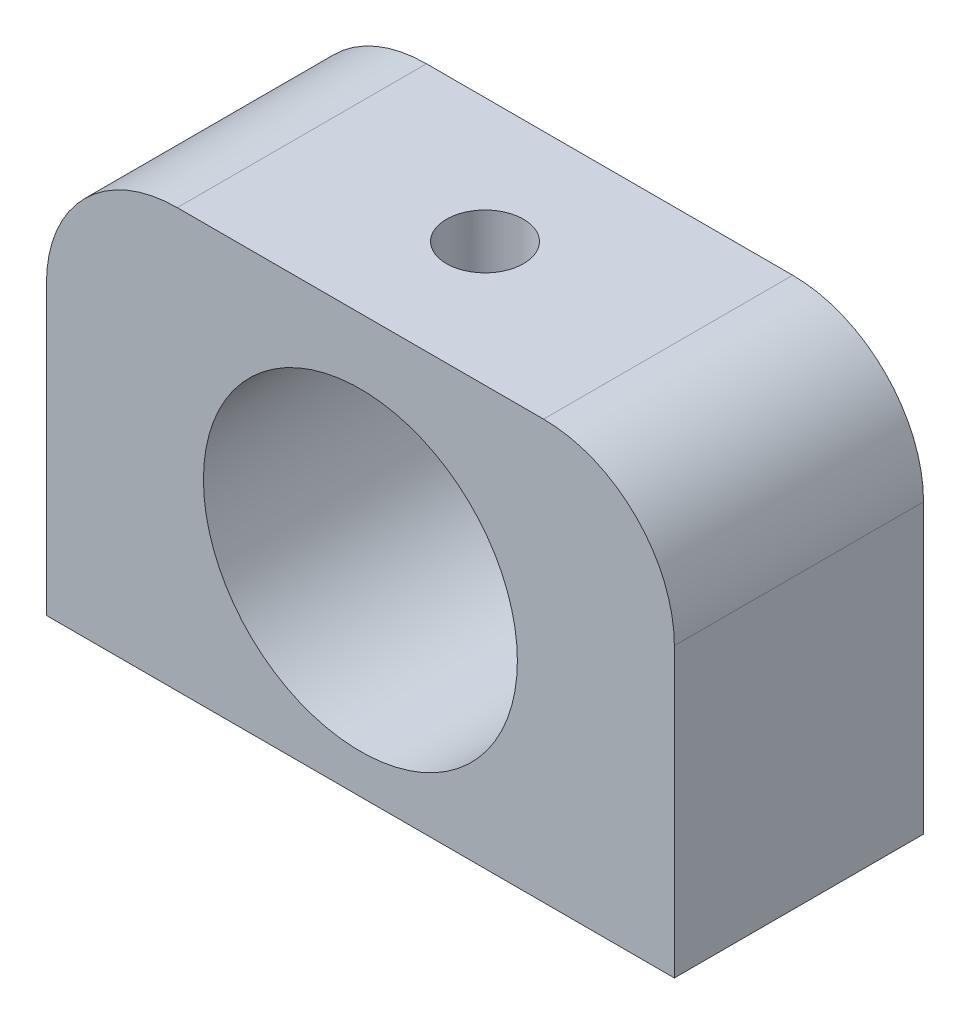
ISO-10303-21;
HEADER;
FILE_DESCRIPTION(('STEP AP214'),'2;1');
FILE_NAME('part.step','',(''),(''),'','','');
FILE_SCHEMA(('AUTOMOTIVE_DESIGN { 1 0 10303 214 1 1 1 1 }'));
ENDSEC;
DATA;
#1=APPLICATION_CONTEXT('core data for automotive mechanical design processes');
#2=APPLICATION_PROTOCOL_DEFINITION('international standard','automotive_design',2000,#1);
#3=PRODUCT_CONTEXT('',#1,'mechanical');
#4=PRODUCT('Part','Part','',(#3));
#5=PRODUCT_RELATED_PRODUCT_CATEGORY('part','',(#4));
#6=PRODUCT_DEFINITION_FORMATION('','',#4);
#7=PRODUCT_DEFINITION_CONTEXT('part definition',#1,'design');
#8=PRODUCT_DEFINITION('design','',#6,#7);
#9=PRODUCT_DEFINITION_SHAPE('','',#8);
#10=(LENGTH_UNIT() NAMED_UNIT(*) SI_UNIT(.MILLI.,.METRE.));
#11=(NAMED_UNIT(*) PLANE_ANGLE_UNIT() SI_UNIT($,.RADIAN.));
#12=(NAMED_UNIT(*) SI_UNIT($,.STERADIAN.) SOLID_ANGLE_UNIT());
#13=UNCERTAINTY_MEASURE_WITH_UNIT(LENGTH_MEASURE(1.E-05),#10,'distance_accuracy_value','');
#14=(GEOMETRIC_REPRESENTATION_CONTEXT(3) GLOBAL_UNCERTAINTY_ASSIGNED_CONTEXT((#13)) GLOBAL_UNIT_ASSIGNED_CONTEXT((#10,
#11,#12)) REPRESENTATION_CONTEXT('',''));
#15=CARTESIAN_POINT('',(0.,0.,0.));
#16=DIRECTION('',(0.,0.,1.));
#17=DIRECTION('',(1.,0.,0.));
#18=AXIS2_PLACEMENT_3D('',#15,#16,#17);
#19=CARTESIAN_POINT('',(0.,0.,9.525));
#20=DIRECTION('',(1.,0.,0.));
#21=DIRECTION('',(0.,0.,-1.));
#22=AXIS2_PLACEMENT_3D('',#19,#20,#21);
#23=PLANE('',#22);
#24=DIRECTION('',(0.,-1.,0.));
#25=VECTOR('',#24,1.);
#26=CARTESIAN_POINT('',(0.,0.,9.525));
#27=LINE('',#26,#25);
#28=CARTESIAN_POINT('',(0.,11.,9.525));
#29=VERTEX_POINT('',#28);
#30=CARTESIAN_POINT('',(0.,0.,9.525));
#31=VERTEX_POINT('',#30);
#32=EDGE_CURVE('E116',#29,#31,#27,.T.);
#33=ORIENTED_EDGE('',*,*,#32,.F.);
#34=DIRECTION('',(0.,0.,-1.));
#35=VECTOR('',#34,1.);
#36=CARTESIAN_POINT('',(0.,11.,9.525));
#37=LINE('',#36,#35);
#38=CARTESIAN_POINT('',(0.,11.,0.));
#39=VERTEX_POINT('',#38);
#40=EDGE_CURVE('E11',#29,#39,#37,.T.);
#41=ORIENTED_EDGE('',*,*,#40,.T.);
#42=DIRECTION('',(0.,-1.,0.));
#43=VECTOR('',#42,1.);
#44=CARTESIAN_POINT('',(0.,0.,0.));
#45=LINE('',#44,#43);
#46=CARTESIAN_POINT('',(0.,0.,0.));
#47=VERTEX_POINT('',#46);
#48=EDGE_CURVE('E115',#39,#47,#45,.T.);
#49=ORIENTED_EDGE('',*,*,#48,.T.);
#50=DIRECTION('',(0.,0.,-1.));
#51=VECTOR('',#50,1.);
#52=CARTESIAN_POINT('',(0.,0.,9.525));
#53=LINE('',#52,#51);
#54=EDGE_CURVE('E135',#31,#47,#53,.T.);
#55=ORIENTED_EDGE('',*,*,#54,.F.);
#56=EDGE_LOOP('',(#33,#41,#49,#55));
#57=FACE_BOUND('',#56,.T.);
#58=ADVANCED_FACE('F32',(#57),#23,.F.);
#59=CARTESIAN_POINT('',(0.,0.,9.525));
#60=DIRECTION('',(0.,1.,0.));
#61=DIRECTION('',(0.,0.,1.));
#62=AXIS2_PLACEMENT_3D('',#59,#60,#61);
#63=PLANE('',#62);
#64=CARTESIAN_POINT('',(3.,0.,4.7625));
#65=DIRECTION('',(0.,-1.,0.));
#66=DIRECTION('',(0.,0.,-1.));
#67=AXIS2_PLACEMENT_3D('',#64,#65,#66);
#68=CIRCLE('',#67,1.63194999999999);
#69=CARTESIAN_POINT('',(3.,0.,3.13055000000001));
#70=VERTEX_POINT('',#69);
#71=EDGE_CURVE('E103',#70,#70,#68,.T.);
#72=ORIENTED_EDGE('',*,*,#71,.F.);
#73=EDGE_LOOP('',(#72));
#74=FACE_BOUND('',#73,.T.);
#75=CARTESIAN_POINT('',(21.,0.,4.7625));
#76=DIRECTION('',(0.,-1.,0.));
#77=DIRECTION('',(0.,0.,-1.));
#78=AXIS2_PLACEMENT_3D('',#75,#76,#77);
#79=CIRCLE('',#78,1.63194999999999);
#80=CARTESIAN_POINT('',(21.,0.,3.13055000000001));
#81=VERTEX_POINT('',#80);
#82=EDGE_CURVE('E102',#81,#81,#79,.T.);
#83=ORIENTED_EDGE('',*,*,#82,.F.);
#84=EDGE_LOOP('',(#83));
#85=FACE_BOUND('',#84,.T.);
#86=DIRECTION('',(1.,0.,0.));
#87=VECTOR('',#86,1.);
#88=CARTESIAN_POINT('',(0.,0.,0.));
#89=LINE('',#88,#87);
#90=CARTESIAN_POINT('',(24.,0.,0.));
#91=VERTEX_POINT('',#90);
#92=EDGE_CURVE('E127',#47,#91,#89,.T.);
#93=ORIENTED_EDGE('',*,*,#92,.T.);
#94=DIRECTION('',(0.,0.,-1.));
#95=VECTOR('',#94,1.);
#96=CARTESIAN_POINT('',(24.,0.,9.525));
#97=LINE('',#96,#95);
#98=CARTESIAN_POINT('',(24.,0.,9.525));
#99=VERTEX_POINT('',#98);
#100=EDGE_CURVE('E125',#99,#91,#97,.T.);
#101=ORIENTED_EDGE('',*,*,#100,.F.);
#102=DIRECTION('',(1.,0.,0.));
#103=VECTOR('',#102,1.);
#104=CARTESIAN_POINT('',(0.,0.,9.525));
#105=LINE('',#104,#103);
#106=EDGE_CURVE('E118',#31,#99,#105,.T.);
#107=ORIENTED_EDGE('',*,*,#106,.F.);
#108=ORIENTED_EDGE('',*,*,#54,.T.);
#109=EDGE_LOOP('',(#93,#101,#107,#108));
#110=FACE_BOUND('',#109,.T.);
#111=ADVANCED_FACE('F166',(#74,#85,#110),#63,.F.);
#112=CARTESIAN_POINT('',(24.,0.,9.525));
#113=DIRECTION('',(-1.,0.,0.));
#114=DIRECTION('',(0.,0.,1.));
#115=AXIS2_PLACEMENT_3D('',#112,#113,#114);
#116=PLANE('',#115);
#117=DIRECTION('',(0.,1.,0.));
#118=VECTOR('',#117,1.);
#119=CARTESIAN_POINT('',(24.,0.,0.));
#120=LINE('',#119,#118);
#121=CARTESIAN_POINT('',(24.,11.,0.));
#122=VERTEX_POINT('',#121);
#123=EDGE_CURVE('E129',#91,#122,#120,.T.);
#124=ORIENTED_EDGE('',*,*,#123,.T.);
#125=DIRECTION('',(0.,0.,-1.));
#126=VECTOR('',#125,1.);
#127=CARTESIAN_POINT('',(24.,11.,9.525));
#128=LINE('',#127,#126);
#129=CARTESIAN_POINT('',(24.,11.,9.525));
#130=VERTEX_POINT('',#129);
#131=EDGE_CURVE('E55',#122,#130,#128,.F.);
#132=ORIENTED_EDGE('',*,*,#131,.T.);
#133=DIRECTION('',(0.,1.,0.));
#134=VECTOR('',#133,1.);
#135=CARTESIAN_POINT('',(24.,0.,9.525));
#136=LINE('',#135,#134);
#137=EDGE_CURVE('E121',#99,#130,#136,.T.);
#138=ORIENTED_EDGE('',*,*,#137,.F.);
#139=ORIENTED_EDGE('',*,*,#100,.T.);
#140=EDGE_LOOP('',(#124,#132,#138,#139));
#141=FACE_BOUND('',#140,.T.);
#142=ADVANCED_FACE('F172',(#141),#116,.F.);
#143=CARTESIAN_POINT('',(0.,16.,9.525));
#144=DIRECTION('',(0.,-1.,0.));
#145=DIRECTION('',(0.,0.,-1.));
#146=AXIS2_PLACEMENT_3D('',#143,#144,#145);
#147=PLANE('',#146);
#148=CARTESIAN_POINT('',(12.,16.,4.7625));
#149=DIRECTION('',(0.,1.,0.));
#150=DIRECTION('',(0.,0.,1.));
#151=AXIS2_PLACEMENT_3D('',#148,#149,#150);
#152=CIRCLE('',#151,1.4732);
#153=CARTESIAN_POINT('',(12.,16.,6.2357));
#154=VERTEX_POINT('',#153);
#155=EDGE_CURVE('E147',#154,#154,#152,.T.);
#156=ORIENTED_EDGE('',*,*,#155,.F.);
#157=EDGE_LOOP('',(#156));
#158=FACE_BOUND('',#157,.T.);
#159=DIRECTION('',(-1.,0.,0.));
#160=VECTOR('',#159,1.);
#161=CARTESIAN_POINT('',(0.,16.,9.525));
#162=LINE('',#161,#160);
#163=CARTESIAN_POINT('',(19.,16.,9.525));
#164=VERTEX_POINT('',#163);
#165=CARTESIAN_POINT('',(5.,16.,9.525));
#166=VERTEX_POINT('',#165);
#167=EDGE_CURVE('E123',#164,#166,#162,.T.);
#168=ORIENTED_EDGE('',*,*,#167,.F.);
#169=DIRECTION('',(0.,0.,-1.));
#170=VECTOR('',#169,1.);
#171=CARTESIAN_POINT('',(19.,16.,9.525));
#172=LINE('',#171,#170);
#173=CARTESIAN_POINT('',(19.,16.,0.));
#174=VERTEX_POINT('',#173);
#175=EDGE_CURVE('E218',#164,#174,#172,.T.);
#176=ORIENTED_EDGE('',*,*,#175,.T.);
#177=DIRECTION('',(-1.,0.,0.));
#178=VECTOR('',#177,1.);
#179=CARTESIAN_POINT('',(0.,16.,0.));
#180=LINE('',#179,#178);
#181=CARTESIAN_POINT('',(5.,16.,0.));
#182=VERTEX_POINT('',#181);
#183=EDGE_CURVE('E119',#174,#182,#180,.T.);
#184=ORIENTED_EDGE('',*,*,#183,.T.);
#185=DIRECTION('',(0.,0.,-1.));
#186=VECTOR('',#185,1.);
#187=CARTESIAN_POINT('',(5.,16.,9.525));
#188=LINE('',#187,#186);
#189=EDGE_CURVE('E138',#182,#166,#188,.F.);
#190=ORIENTED_EDGE('',*,*,#189,.T.);
#191=EDGE_LOOP('',(#168,#176,#184,#190));
#192=FACE_BOUND('',#191,.T.);
#193=ADVANCED_FACE('F178',(#158,#192),#147,.F.);
#194=CARTESIAN_POINT('',(0.,0.,9.525));
#195=DIRECTION('',(0.,0.,-1.));
#196=DIRECTION('',(-1.,0.,0.));
#197=AXIS2_PLACEMENT_3D('',#194,#195,#196);
#198=PLANE('',#197);
#199=CARTESIAN_POINT('',(12.,7.5,9.525));
#200=DIRECTION('',(0.,0.,1.));
#201=DIRECTION('',(1.,0.,0.));
#202=AXIS2_PLACEMENT_3D('',#199,#200,#201);
#203=CIRCLE('',#202,6.);
#204=CARTESIAN_POINT('',(18.,7.5,9.525));
#205=VERTEX_POINT('',#204);
#206=EDGE_CURVE('E146',#205,#205,#203,.T.);
#207=ORIENTED_EDGE('',*,*,#206,.F.);
#208=EDGE_LOOP('',(#207));
#209=FACE_BOUND('',#208,.T.);
#210=ORIENTED_EDGE('',*,*,#137,.T.);
#211=CARTESIAN_POINT('',(19.,11.,9.525));
#212=DIRECTION('',(0.,0.,-1.));
#213=DIRECTION('',(-1.,0.,0.));
#214=AXIS2_PLACEMENT_3D('',#211,#212,#213);
#215=CIRCLE('',#214,5.);
#216=EDGE_CURVE('E40',#130,#164,#215,.F.);
#217=ORIENTED_EDGE('',*,*,#216,.T.);
#218=ORIENTED_EDGE('',*,*,#167,.T.);
#219=CARTESIAN_POINT('',(5.,11.,9.525));
#220=DIRECTION('',(0.,0.,-1.));
#221=DIRECTION('',(-1.,0.,0.));
#222=AXIS2_PLACEMENT_3D('',#219,#220,#221);
#223=CIRCLE('',#222,5.);
#224=EDGE_CURVE('E47',#166,#29,#223,.F.);
#225=ORIENTED_EDGE('',*,*,#224,.T.);
#226=ORIENTED_EDGE('',*,*,#32,.T.);
#227=ORIENTED_EDGE('',*,*,#106,.T.);
#228=EDGE_LOOP('',(#210,#217,#218,#225,#226,#227));
#229=FACE_BOUND('',#228,.T.);
#230=ADVANCED_FACE('F181',(#209,#229),#198,.F.);
#231=CARTESIAN_POINT('',(0.,0.,0.));
#232=DIRECTION('',(0.,0.,-1.));
#233=DIRECTION('',(-1.,0.,0.));
#234=AXIS2_PLACEMENT_3D('',#231,#232,#233);
#235=PLANE('',#234);
#236=CARTESIAN_POINT('',(12.,7.5,0.));
#237=DIRECTION('',(0.,0.,1.));
#238=DIRECTION('',(1.,0.,0.));
#239=AXIS2_PLACEMENT_3D('',#236,#237,#238);
#240=CIRCLE('',#239,6.);
#241=CARTESIAN_POINT('',(18.,7.5,0.));
#242=VERTEX_POINT('',#241);
#243=EDGE_CURVE('E109',#242,#242,#240,.T.);
#244=ORIENTED_EDGE('',*,*,#243,.T.);
#245=EDGE_LOOP('',(#244));
#246=FACE_BOUND('',#245,.T.);
#247=ORIENTED_EDGE('',*,*,#183,.F.);
#248=CARTESIAN_POINT('',(19.,11.,0.));
#249=DIRECTION('',(0.,0.,-1.));
#250=DIRECTION('',(-1.,0.,0.));
#251=AXIS2_PLACEMENT_3D('',#248,#249,#250);
#252=CIRCLE('',#251,5.);
#253=EDGE_CURVE('E212',#174,#122,#252,.T.);
#254=ORIENTED_EDGE('',*,*,#253,.T.);
#255=ORIENTED_EDGE('',*,*,#123,.F.);
#256=ORIENTED_EDGE('',*,*,#92,.F.);
#257=ORIENTED_EDGE('',*,*,#48,.F.);
#258=CARTESIAN_POINT('',(5.,11.,0.));
#259=DIRECTION('',(0.,0.,-1.));
#260=DIRECTION('',(-1.,0.,0.));
#261=AXIS2_PLACEMENT_3D('',#258,#259,#260);
#262=CIRCLE('',#261,5.);
#263=EDGE_CURVE('E215',#39,#182,#262,.T.);
#264=ORIENTED_EDGE('',*,*,#263,.T.);
#265=EDGE_LOOP('',(#247,#254,#255,#256,#257,#264));
#266=FACE_BOUND('',#265,.T.);
#267=ADVANCED_FACE('F183',(#246,#266),#235,.T.);
#268=CARTESIAN_POINT('',(21.,12.7,4.7625));
#269=DIRECTION('',(0.,-1.,0.));
#270=DIRECTION('',(0.,0.,-1.));
#271=AXIS2_PLACEMENT_3D('',#268,#269,#270);
#272=CONICAL_SURFACE('',#271,1.63195,1.02974425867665);
#273=CARTESIAN_POINT('',(21.,13.680574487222,4.7625));
#274=VERTEX_POINT('',#273);
#275=VERTEX_LOOP('',#274);
#276=FACE_BOUND('',#275,.T.);
#277=CARTESIAN_POINT('',(21.,12.7,4.7625));
#278=DIRECTION('',(0.,-1.,0.));
#279=DIRECTION('',(0.,0.,-1.));
#280=AXIS2_PLACEMENT_3D('',#277,#278,#279);
#281=CIRCLE('',#280,1.63195);
#282=CARTESIAN_POINT('',(21.,12.7,3.13055));
#283=VERTEX_POINT('',#282);
#284=EDGE_CURVE('E106',#283,#283,#281,.T.);
#285=ORIENTED_EDGE('',*,*,#284,.T.);
#286=EDGE_LOOP('',(#285));
#287=FACE_BOUND('',#286,.T.);
#288=ADVANCED_FACE('F186',(#276,#287),#272,.F.);
#289=CARTESIAN_POINT('',(21.,0.,4.7625));
#290=DIRECTION('',(0.,-1.,0.));
#291=DIRECTION('',(0.,0.,-1.));
#292=AXIS2_PLACEMENT_3D('',#289,#290,#291);
#293=CYLINDRICAL_SURFACE('',#292,1.63194999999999);
#294=ORIENTED_EDGE('',*,*,#284,.F.);
#295=EDGE_LOOP('',(#294));
#296=FACE_BOUND('',#295,.T.);
#297=ORIENTED_EDGE('',*,*,#82,.T.);
#298=EDGE_LOOP('',(#297));
#299=FACE_BOUND('',#298,.T.);
#300=ADVANCED_FACE('F96',(#296,#299),#293,.F.);
#301=CARTESIAN_POINT('',(3.,12.7,4.7625));
#302=DIRECTION('',(0.,-1.,0.));
#303=DIRECTION('',(0.,0.,-1.));
#304=AXIS2_PLACEMENT_3D('',#301,#302,#303);
#305=CONICAL_SURFACE('',#304,1.63195,1.02974425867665);
#306=CARTESIAN_POINT('',(3.,13.680574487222,4.7625));
#307=VERTEX_POINT('',#306);
#308=VERTEX_LOOP('',#307);
#309=FACE_BOUND('',#308,.T.);
#310=CARTESIAN_POINT('',(3.,12.7,4.7625));
#311=DIRECTION('',(0.,-1.,0.));
#312=DIRECTION('',(0.,0.,-1.));
#313=AXIS2_PLACEMENT_3D('',#310,#311,#312);
#314=CIRCLE('',#313,1.63195);
#315=CARTESIAN_POINT('',(3.,12.7,3.13055));
#316=VERTEX_POINT('',#315);
#317=EDGE_CURVE('E100',#316,#316,#314,.T.);
#318=ORIENTED_EDGE('',*,*,#317,.T.);
#319=EDGE_LOOP('',(#318));
#320=FACE_BOUND('',#319,.T.);
#321=ADVANCED_FACE('F92',(#309,#320),#305,.F.);
#322=CARTESIAN_POINT('',(3.,0.,4.7625));
#323=DIRECTION('',(0.,-1.,0.));
#324=DIRECTION('',(0.,0.,-1.));
#325=AXIS2_PLACEMENT_3D('',#322,#323,#324);
#326=CYLINDRICAL_SURFACE('',#325,1.63194999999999);
#327=ORIENTED_EDGE('',*,*,#317,.F.);
#328=EDGE_LOOP('',(#327));
#329=FACE_BOUND('',#328,.T.);
#330=ORIENTED_EDGE('',*,*,#71,.T.);
#331=EDGE_LOOP('',(#330));
#332=FACE_BOUND('',#331,.T.);
#333=ADVANCED_FACE('F95',(#329,#332),#326,.F.);
#334=CARTESIAN_POINT('',(12.,7.5,0.));
#335=DIRECTION('',(0.,0.,1.));
#336=DIRECTION('',(1.,0.,0.));
#337=AXIS2_PLACEMENT_3D('',#334,#335,#336);
#338=CYLINDRICAL_SURFACE('',#337,6.);
#339=CARTESIAN_POINT('',(12.,13.5,6.2357));
#340=CARTESIAN_POINT('',(12.081442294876,13.4999985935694,6.2356976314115));
#341=CARTESIAN_POINT('',(12.1629113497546,13.4983252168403,6.22892375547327));
#342=CARTESIAN_POINT('',(12.323517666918,13.4918118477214,6.20204592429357));
#343=CARTESIAN_POINT('',(12.4026535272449,13.4869699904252,6.18193411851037));
#344=CARTESIAN_POINT('',(12.5562506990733,13.47465626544,6.12906223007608));
#345=CARTESIAN_POINT('',(12.6307173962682,13.4671874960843,6.09631704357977));
#346=CARTESIAN_POINT('',(12.7731002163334,13.4504169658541,6.01915956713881));
#347=CARTESIAN_POINT('',(12.8410161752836,13.4411151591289,5.97474698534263));
#348=CARTESIAN_POINT('',(12.9697227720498,13.4214826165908,5.8745807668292));
#349=CARTESIAN_POINT('',(13.0303643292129,13.4111364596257,5.81863858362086));
#350=CARTESIAN_POINT('',(13.1415054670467,13.3906846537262,5.69740499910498));
#351=CARTESIAN_POINT('',(13.1920039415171,13.38057903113,5.63211257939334));
#352=CARTESIAN_POINT('',(13.2821200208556,13.3615975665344,5.49288270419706));
#353=CARTESIAN_POINT('',(13.3215720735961,13.3527413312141,5.41883518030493));
#354=CARTESIAN_POINT('',(13.3874111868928,13.3374857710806,5.26490666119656));
#355=CARTESIAN_POINT('',(13.4138002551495,13.3310860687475,5.18502656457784));
#356=CARTESIAN_POINT('',(13.4522581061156,13.3216264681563,5.02333650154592));
#357=CARTESIAN_POINT('',(13.4645943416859,13.3185042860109,4.9415938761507));
#358=CARTESIAN_POINT('',(13.4754292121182,13.3157667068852,4.77714425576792));
#359=CARTESIAN_POINT('',(13.4739300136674,13.3161507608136,4.69443741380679));
#360=CARTESIAN_POINT('',(13.4573502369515,13.3203262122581,4.53244744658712));
#361=CARTESIAN_POINT('',(13.4425871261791,13.3240379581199,4.45312945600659));
#362=CARTESIAN_POINT('',(13.400404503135,13.3343237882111,4.29813185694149));
#363=CARTESIAN_POINT('',(13.3729841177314,13.340898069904,4.22245249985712));
#364=CARTESIAN_POINT('',(13.305991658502,13.3562421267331,4.07602298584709));
#365=CARTESIAN_POINT('',(13.2663033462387,13.3650327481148,4.00532828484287));
#366=CARTESIAN_POINT('',(13.1759829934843,13.3838070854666,3.87148774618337));
#367=CARTESIAN_POINT('',(13.1253491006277,13.3937910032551,3.80834318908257));
#368=CARTESIAN_POINT('',(13.0129250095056,13.4141633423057,3.68957476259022));
#369=CARTESIAN_POINT('',(12.9508665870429,13.42455534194,3.6342050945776));
#370=CARTESIAN_POINT('',(12.8182214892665,13.4443252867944,3.53461147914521));
#371=CARTESIAN_POINT('',(12.7476345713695,13.4537032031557,3.49038784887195));
#372=CARTESIAN_POINT('',(12.5995814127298,13.4704323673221,3.41425299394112));
#373=CARTESIAN_POINT('',(12.5220937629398,13.4777769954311,3.38238185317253));
#374=CARTESIAN_POINT('',(12.362640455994,13.4895637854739,3.33218787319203));
#375=CARTESIAN_POINT('',(12.280675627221,13.4940064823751,3.31386253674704));
#376=CARTESIAN_POINT('',(12.1167690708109,13.4994101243,3.29166577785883));
#377=CARTESIAN_POINT('',(12.0348769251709,13.5004544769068,3.28744803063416));
#378=CARTESIAN_POINT('',(11.871557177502,13.4991807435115,3.29263798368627));
#379=CARTESIAN_POINT('',(11.7901295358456,13.4968629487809,3.30204450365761));
#380=CARTESIAN_POINT('',(11.6312452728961,13.4891786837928,3.33393020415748));
#381=CARTESIAN_POINT('',(11.5537486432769,13.4838560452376,3.35622154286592));
#382=CARTESIAN_POINT('',(11.4035980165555,13.4707612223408,3.41303046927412));
#383=CARTESIAN_POINT('',(11.3309444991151,13.4629887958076,3.44754926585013));
#384=CARTESIAN_POINT('',(11.191156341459,13.4456557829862,3.52851194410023));
#385=CARTESIAN_POINT('',(11.1241384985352,13.4360666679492,3.57515123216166));
#386=CARTESIAN_POINT('',(10.9987573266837,13.4162107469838,3.67878010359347));
#387=CARTESIAN_POINT('',(10.9403954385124,13.4059438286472,3.73577140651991));
#388=CARTESIAN_POINT('',(10.8325642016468,13.3855909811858,3.86009204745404));
#389=CARTESIAN_POINT('',(10.7833373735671,13.375515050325,3.92763372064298));
#390=CARTESIAN_POINT('',(10.696918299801,13.3569564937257,4.07022467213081));
#391=CARTESIAN_POINT('',(10.6597255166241,13.3484737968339,4.1452736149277));
#392=CARTESIAN_POINT('',(10.5987049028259,13.3341541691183,4.30034254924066));
#393=CARTESIAN_POINT('',(10.574797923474,13.3283016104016,4.38032987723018));
#394=CARTESIAN_POINT('',(10.5408146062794,13.3198874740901,4.54335333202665));
#395=CARTESIAN_POINT('',(10.5307353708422,13.3173252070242,4.62638881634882));
#396=CARTESIAN_POINT('',(10.5248409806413,13.3158329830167,4.79068726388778));
#397=CARTESIAN_POINT('',(10.5286387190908,13.3168044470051,4.87193567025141));
#398=CARTESIAN_POINT('',(10.5495076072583,13.3220430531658,5.03259571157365));
#399=CARTESIAN_POINT('',(10.5665785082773,13.3263101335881,5.11200738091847));
#400=CARTESIAN_POINT('',(10.6133012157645,13.3376052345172,5.26633590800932));
#401=CARTESIAN_POINT('',(10.6428828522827,13.3446178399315,5.3412752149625));
#402=CARTESIAN_POINT('',(10.7137313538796,13.3606165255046,5.48517955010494));
#403=CARTESIAN_POINT('',(10.7549997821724,13.3696028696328,5.55414377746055));
#404=CARTESIAN_POINT('',(10.8492745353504,13.388819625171,5.68601670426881));
#405=CARTESIAN_POINT('',(10.9025505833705,13.3990756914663,5.74872887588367));
#406=CARTESIAN_POINT('',(11.0187994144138,13.4195204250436,5.8644490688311));
#407=CARTESIAN_POINT('',(11.081774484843,13.4297090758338,5.91745479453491));
#408=CARTESIAN_POINT('',(11.2169484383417,13.4490811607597,6.01314934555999));
#409=CARTESIAN_POINT('',(11.2892880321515,13.4582441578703,6.05564384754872));
#410=CARTESIAN_POINT('',(11.4403013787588,13.474318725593,6.12780116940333));
#411=CARTESIAN_POINT('',(11.518970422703,13.4812319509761,6.15747342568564));
#412=CARTESIAN_POINT('',(11.664612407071,13.4909736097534,6.19860415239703));
#413=CARTESIAN_POINT('',(11.7308759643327,13.4943356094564,6.2124855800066));
#414=CARTESIAN_POINT('',(11.8647535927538,13.4988493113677,6.23103416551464));
#415=CARTESIAN_POINT('',(11.9323675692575,13.5000011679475,6.23570196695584));
#416=CARTESIAN_POINT('',(12.,13.5,6.2357));
#417=B_SPLINE_CURVE_WITH_KNOTS('',3,(#339,#340,#341,#342,#343,#344,#345,#346,#347,#348,#349,
#350,#351,#352,#353,#354,#355,#356,#357,#358,#359,#360,#361,#362,#363,#364,#365,#366,#367,#368,
#369,#370,#371,#372,#373,#374,#375,#376,#377,#378,#379,#380,#381,#382,#383,#384,#385,#386,#387,
#388,#389,#390,#391,#392,#393,#394,#395,#396,#397,#398,#399,#400,#401,#402,#403,#404,#405,#406,
#407,#408,#409,#410,#411,#412,#413,#414,#415,#416),.UNSPECIFIED.,.T.,.F.,(4,2,2,2,2,2,2,2,2,2,2,
2,2,2,2,2,2,2,2,2,2,2,2,2,2,2,2,2,2,2,2,2,2,2,2,2,2,2,4),(0.,0.244079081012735,
0.488301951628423,0.732237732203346,0.976179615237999,1.22448235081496,1.47281215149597,
1.72468559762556,1.97652032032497,2.22347757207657,2.47039614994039,2.71155777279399,
2.95273603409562,3.19627338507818,3.43985198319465,3.6901207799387,3.94039669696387,
4.19147809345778,4.44251319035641,4.68733858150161,4.93214276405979,5.17346497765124,
5.41481105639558,5.66031968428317,5.90586913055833,6.15721673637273,6.40855311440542,
6.65837567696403,6.90814588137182,7.15100245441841,7.3938544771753,7.63536209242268,
7.87690202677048,8.12453215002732,8.37222076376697,8.62419391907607,8.87598131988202,
9.07868698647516,9.28137849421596),.UNSPECIFIED.);
#418=CARTESIAN_POINT('',(12.,13.5,6.2357));
#419=VERTEX_POINT('',#418);
#420=EDGE_CURVE('E139',#419,#419,#417,.T.);
#421=ORIENTED_EDGE('',*,*,#420,.T.);
#422=EDGE_LOOP('',(#421));
#423=FACE_BOUND('',#422,.T.);
#424=ORIENTED_EDGE('',*,*,#243,.F.);
#425=EDGE_LOOP('',(#424));
#426=FACE_BOUND('',#425,.T.);
#427=ORIENTED_EDGE('',*,*,#206,.T.);
#428=EDGE_LOOP('',(#427));
#429=FACE_BOUND('',#428,.T.);
#430=ADVANCED_FACE('F149',(#423,#426,#429),#338,.F.);
#431=CARTESIAN_POINT('',(12.,16.,4.7625));
#432=DIRECTION('',(0.,1.,0.));
#433=DIRECTION('',(0.,0.,1.));
#434=AXIS2_PLACEMENT_3D('',#431,#432,#433);
#435=CYLINDRICAL_SURFACE('',#434,1.4732);
#436=ORIENTED_EDGE('',*,*,#155,.T.);
#437=EDGE_LOOP('',(#436));
#438=FACE_BOUND('',#437,.T.);
#439=ORIENTED_EDGE('',*,*,#420,.F.);
#440=EDGE_LOOP('',(#439));
#441=FACE_BOUND('',#440,.T.);
#442=ADVANCED_FACE('F152',(#438,#441),#435,.F.);
#443=CARTESIAN_POINT('',(19.,11.,9.525));
#444=DIRECTION('',(0.,0.,-1.));
#445=DIRECTION('',(-1.,0.,0.));
#446=AXIS2_PLACEMENT_3D('',#443,#444,#445);
#447=CYLINDRICAL_SURFACE('',#446,5.);
#448=ORIENTED_EDGE('',*,*,#216,.F.);
#449=ORIENTED_EDGE('',*,*,#131,.F.);
#450=ORIENTED_EDGE('',*,*,#253,.F.);
#451=ORIENTED_EDGE('',*,*,#175,.F.);
#452=EDGE_LOOP('',(#448,#449,#450,#451));
#453=FACE_BOUND('',#452,.T.);
#454=ADVANCED_FACE('F155',(#453),#447,.T.);
#455=CARTESIAN_POINT('',(5.,11.,9.525));
#456=DIRECTION('',(0.,0.,-1.));
#457=DIRECTION('',(-1.,0.,0.));
#458=AXIS2_PLACEMENT_3D('',#455,#456,#457);
#459=CYLINDRICAL_SURFACE('',#458,5.);
#460=ORIENTED_EDGE('',*,*,#224,.F.);
#461=ORIENTED_EDGE('',*,*,#189,.F.);
#462=ORIENTED_EDGE('',*,*,#263,.F.);
#463=ORIENTED_EDGE('',*,*,#40,.F.);
#464=EDGE_LOOP('',(#460,#461,#462,#463));
#465=FACE_BOUND('',#464,.T.);
#466=ADVANCED_FACE('F34',(#465),#459,.T.);
#467=CLOSED_SHELL('',(#58,#111,#142,#193,#230,#267,#288,#300,#321,#333,#430,#442,#454,#466));
#468=MANIFOLD_SOLID_BREP('B2',#467);
#469=ADVANCED_BREP_SHAPE_REPRESENTATION('',(#18,#468),#14);
#470=SHAPE_DEFINITION_REPRESENTATION(#9,#469);
ENDSEC;
END-ISO-10303-21;
